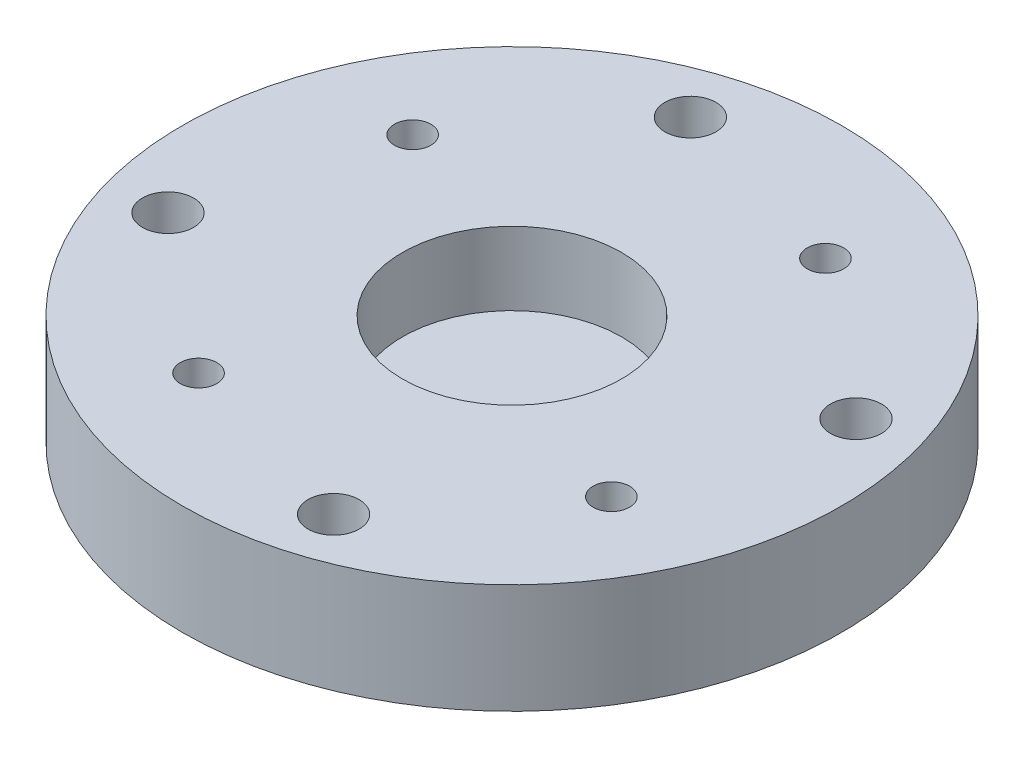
from build123d import *

# Parameters (mm, degrees)
PER_AGE1_D                   = 7
PER_AGE1_CBORE_D             = 12
PER_AGE1_CBORE_DEPTH         = 7
R_P_TITION_CIRCULAIRE1_COUNT = 4
TROU_TARAUD_M61_D            = 5
R_P_TITION_CIRCULAIRE3_COUNT = 4


with BuildPart() as part:
    # Esquisse1 → R_volution1 (revolve)
    with BuildSketch(Plane.XY, mode=Mode.PRIVATE) as r_volution1_sk:
        Polygon((0, 0), (45.1, 0), (45.1, 15), (15, 15), (15, 5), (0, 5), align=None)
    revolve(r_volution1_sk.sketch.rotate(Axis((0, 28.171245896, 0), (0, -1, 0)), 90), axis=Axis((0, 28.171245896, 0), (0, -1, 0)))

    # Per_age1 (through all)
    with Locations(Plane.XZ):
        with Locations((-35.747096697, 11.33115518)):
            per_age1 = CounterBoreHole(PER_AGE1_D / 2, PER_AGE1_CBORE_D / 2, PER_AGE1_CBORE_DEPTH)

    # R_p_tition circulaire1: Per_age1 ×4 about axis
    r_p_tition_circulaire1_axis = Axis((0, 0, 0), (0, 1, 0))
    for i in range(1, R_P_TITION_CIRCULAIRE1_COUNT):
        add(per_age1.rotate(r_p_tition_circulaire1_axis, i * 360 / R_P_TITION_CIRCULAIRE1_COUNT), mode=Mode.SUBTRACT)

    # Trou taraud_ M61 (through all)
    with Locations(Plane.XZ):
        with Locations((-14.649564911, 28.246951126)):
            trou_taraud_m61 = Hole(TROU_TARAUD_M61_D / 2)

    # R_p_tition circulaire3: Trou taraud_ M61 ×4 about axis
    r_p_tition_circulaire3_axis = Axis((0, 0, 0), (0, 1, 0))
    for i in range(1, R_P_TITION_CIRCULAIRE3_COUNT):
        add(trou_taraud_m61.rotate(r_p_tition_circulaire3_axis, i * 360 / R_P_TITION_CIRCULAIRE3_COUNT), mode=Mode.SUBTRACT)


solid = part.part
